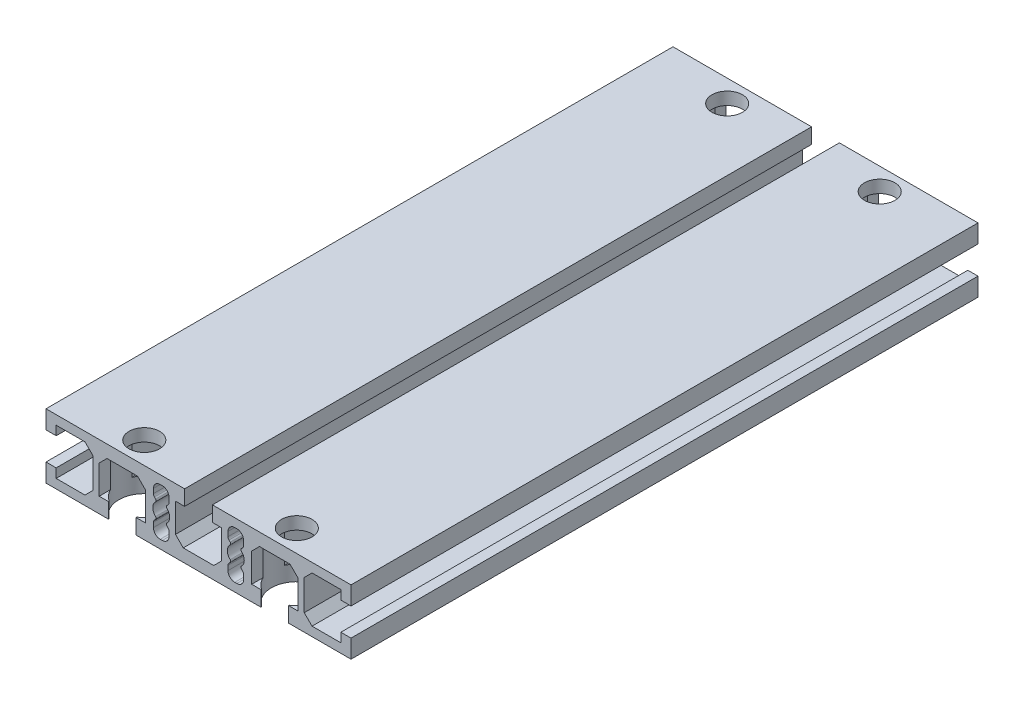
from build123d import *

# Parameters (mm, degrees)
BOSS_EXTRUDE1_DEPTH                     = 92.5
BOSS_EXTRUDE1_DEPTH_BACK                = 92.5
CBORE_FOR_M8_HEX_HEAD_BOLT1_D           = 9
CBORE_FOR_M8_HEX_HEAD_BOLT1_CBORE_D     = 15
CBORE_FOR_M8_HEX_HEAD_BOLT1_CBORE_DEPTH = 15.3


with BuildPart() as part:
    # Sketch1 → Boss-Extrude1 (new, two sides: drawn at the far end of the back side and taken through both)
    with BuildSketch(Plane.XY.offset(-BOSS_EXTRUDE1_DEPTH_BACK)):
        Polygon((-15.7, 3.5), (-15.7, -5), (-18.4, -5), (-18.4, -9.5), (18.4, -9.5), (18.4, -5), (15.7, -5), (15.7, 3.5), (18, 5.8), (27, 5.8), (29.3, 3.5), (29.3, -5), (26.6, -5), (26.6, -9.5), (45, -9.5), (45, -4.1), (42, -4.1), (42, -6.8), (33.5, -6.8), (31.2, -4.5), (31.2, 4.5), (33.5, 6.8), (42, 6.8), (42, 4.1), (45, 4.1), (45, 9.5), (4.1, 9.5), (4.1, 5), (6.8, 5), (6.8, -3.5), (4.5, -5.8), (-4.5, -5.8), (-6.8, -3.5), (-6.8, 5), (-4.1, 5), (-4.1, 9.5), (-45, 9.5), (-45, 4.1), (-42, 4.1), (-42, 6.8), (-33.5, 6.8), (-31.2, 4.5), (-31.2, -4.5), (-33.5, -6.8), (-42, -6.8), (-42, -4.1), (-45, -4.1), (-45, -9.5), (-26.6, -9.5), (-26.6, -5), (-29.3, -5), (-29.3, 3.5), (-27, 5.8), (-18, 5.8), align=None)
        with BuildLine():
            Line((-13.299970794, -4.999975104), (-13.299970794, -3.657373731))
            ThreePointArc((-13.299970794, -3.657373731), (-13.223850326, -3.274690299), (-13.007077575, -2.95026695))
            Line((-13.007077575, -2.95026695), (-12.646417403, -2.589606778))
            ThreePointArc((-12.646417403, -2.589606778), (-12.500164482, -2.222137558), (-12.66663746, -1.863375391))
            ThreePointArc((-12.66663746, -1.863375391), (-13.499970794, 1.459e-05), (-12.66663746, 1.863404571))
            ThreePointArc((-12.66663746, 1.863404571), (-12.500164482, 2.222166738), (-12.646417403, 2.589635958))
            Line((-12.646417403, 2.589635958), (-13.007077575, 2.95029613))
            ThreePointArc((-13.007077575, 2.95029613), (-13.223850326, 3.274719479), (-13.299970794, 3.657402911))
            Line((-13.299970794, 3.657402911), (-13.299970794, 5.000004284))
            ThreePointArc((-13.299970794, 5.000004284), (-12.714184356, 6.414217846), (-11.299970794, 7.000004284))
            Line((-11.299970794, 7.000004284), (-10.699970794, 7.000004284))
            ThreePointArc((-10.699970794, 7.000004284), (-9.285757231, 6.414217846), (-8.699970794, 5.000004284))
            Line((-8.699970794, 5.000004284), (-8.699970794, 3.657402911))
            ThreePointArc((-8.699970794, 3.657402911), (-8.776091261, 3.274719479), (-8.992864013, 2.95029613))
            Line((-8.992864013, 2.95029613), (-9.353524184, 2.589635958))
            ThreePointArc((-9.353524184, 2.589635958), (-9.499777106, 2.222166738), (-9.333304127, 1.863404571))
            ThreePointArc((-9.333304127, 1.863404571), (-8.499970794, 1.459e-05), (-9.333304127, -1.863375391))
            ThreePointArc((-9.333304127, -1.863375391), (-9.499777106, -2.222137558), (-9.353524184, -2.589606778))
            Line((-9.353524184, -2.589606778), (-8.992864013, -2.95026695))
            ThreePointArc((-8.992864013, -2.95026695), (-8.776091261, -3.274690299), (-8.699970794, -3.657373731))
            Line((-8.699970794, -3.657373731), (-8.699970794, -4.999975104))
            ThreePointArc((-8.699970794, -4.999975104), (-9.285757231, -6.414188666), (-10.699970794, -6.999975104))
            Line((-10.699970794, -6.999975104), (-11.299970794, -6.999975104))
            ThreePointArc((-11.299970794, -6.999975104), (-12.714184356, -6.414188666), (-13.299970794, -4.999975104))
        make_face(mode=Mode.SUBTRACT)
        with BuildLine():
            Line((13.007077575, 2.95029613), (12.646417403, 2.589635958))
            ThreePointArc((12.646417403, 2.589635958), (12.500164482, 2.222166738), (12.66663746, 1.863404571))
            ThreePointArc((12.66663746, 1.863404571), (13.499970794, 1.459e-05), (12.66663746, -1.863375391))
            ThreePointArc((12.66663746, -1.863375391), (12.500164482, -2.222137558), (12.646417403, -2.589606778))
            Line((12.646417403, -2.589606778), (13.007077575, -2.95026695))
            ThreePointArc((13.007077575, -2.95026695), (13.223850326, -3.274690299), (13.299970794, -3.657373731))
            Line((13.299970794, -3.657373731), (13.299970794, -4.999975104))
            ThreePointArc((13.299970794, -4.999975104), (12.714184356, -6.414188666), (11.299970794, -6.999975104))
            Line((11.299970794, -6.999975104), (10.699970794, -6.999975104))
            ThreePointArc((10.699970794, -6.999975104), (9.285757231, -6.414188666), (8.699970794, -4.999975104))
            Line((8.699970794, -4.999975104), (8.699970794, -3.657373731))
            ThreePointArc((8.699970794, -3.657373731), (8.776091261, -3.274690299), (8.992864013, -2.95026695))
            Line((8.992864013, -2.95026695), (9.353524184, -2.589606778))
            ThreePointArc((9.353524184, -2.589606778), (9.499777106, -2.222137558), (9.333304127, -1.863375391))
            ThreePointArc((9.333304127, -1.863375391), (8.499970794, 1.459e-05), (9.333304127, 1.863404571))
            ThreePointArc((9.333304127, 1.863404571), (9.499777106, 2.222166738), (9.353524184, 2.589635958))
            Line((9.353524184, 2.589635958), (8.992864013, 2.95029613))
            ThreePointArc((8.992864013, 2.95029613), (8.776091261, 3.274719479), (8.699970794, 3.657402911))
            Line((8.699970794, 3.657402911), (8.699970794, 5.000004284))
            ThreePointArc((8.699970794, 5.000004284), (9.285757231, 6.414217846), (10.699970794, 7.000004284))
            Line((10.699970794, 7.000004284), (11.299970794, 7.000004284))
            ThreePointArc((11.299970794, 7.000004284), (12.714184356, 6.414217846), (13.299970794, 5.000004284))
            Line((13.299970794, 5.000004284), (13.299970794, 3.657402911))
            ThreePointArc((13.299970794, 3.657402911), (13.223850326, 3.274719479), (13.007077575, 2.95029613))
        make_face(mode=Mode.SUBTRACT)
    extrude(amount=BOSS_EXTRUDE1_DEPTH + BOSS_EXTRUDE1_DEPTH_BACK)

    # CBORE for M8 Hex Head Bolt1 (through all)
    with Locations(Plane.XZ.offset(9.5)):
        with Locations((-22.5, 86), (-22.5, -86), (22.5, -86), (22.5, 86)):
            CounterBoreHole(CBORE_FOR_M8_HEX_HEAD_BOLT1_D / 2, CBORE_FOR_M8_HEX_HEAD_BOLT1_CBORE_D / 2, CBORE_FOR_M8_HEX_HEAD_BOLT1_CBORE_DEPTH)


solid = part.part
